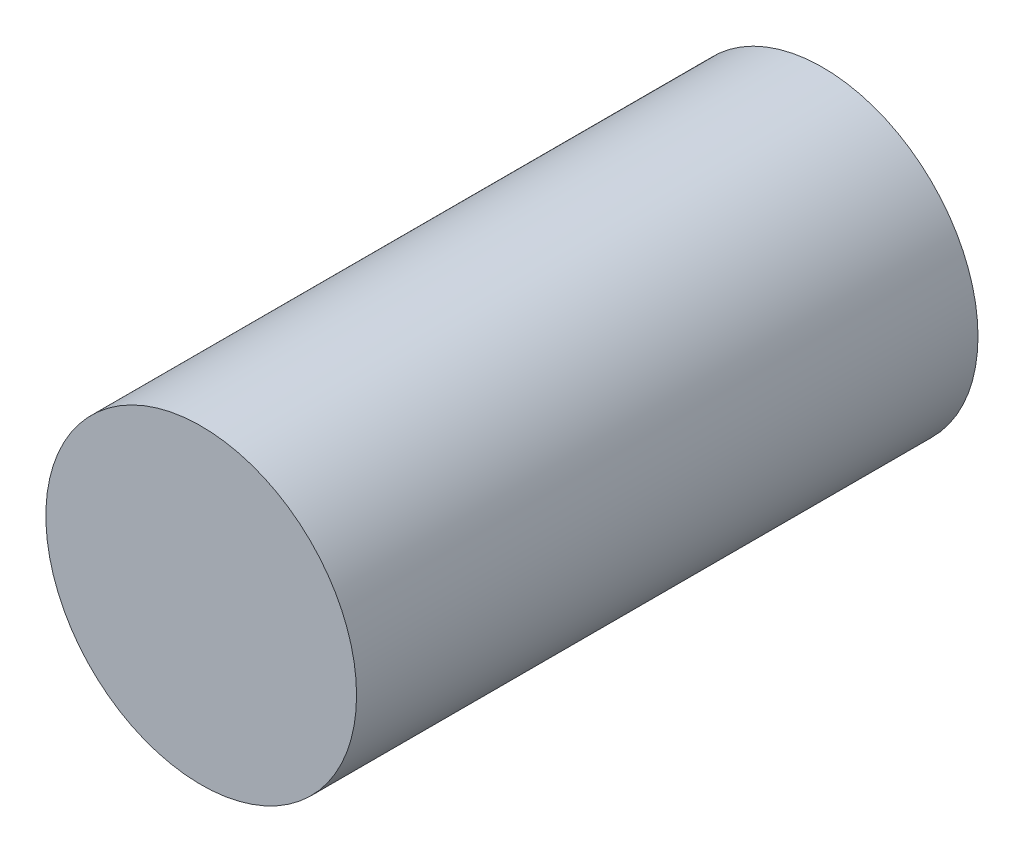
ISO-10303-21;
HEADER;
FILE_DESCRIPTION(('STEP AP214'),'2;1');
FILE_NAME('part.step','',(''),(''),'','','');
FILE_SCHEMA(('AUTOMOTIVE_DESIGN { 1 0 10303 214 1 1 1 1 }'));
ENDSEC;
DATA;
#1=APPLICATION_CONTEXT('core data for automotive mechanical design processes');
#2=APPLICATION_PROTOCOL_DEFINITION('international standard','automotive_design',2000,#1);
#3=PRODUCT_CONTEXT('',#1,'mechanical');
#4=PRODUCT('Part','Part','',(#3));
#5=PRODUCT_RELATED_PRODUCT_CATEGORY('part','',(#4));
#6=PRODUCT_DEFINITION_FORMATION('','',#4);
#7=PRODUCT_DEFINITION_CONTEXT('part definition',#1,'design');
#8=PRODUCT_DEFINITION('design','',#6,#7);
#9=PRODUCT_DEFINITION_SHAPE('','',#8);
#10=(LENGTH_UNIT() NAMED_UNIT(*) SI_UNIT(.MILLI.,.METRE.));
#11=(NAMED_UNIT(*) PLANE_ANGLE_UNIT() SI_UNIT($,.RADIAN.));
#12=(NAMED_UNIT(*) SI_UNIT($,.STERADIAN.) SOLID_ANGLE_UNIT());
#13=UNCERTAINTY_MEASURE_WITH_UNIT(LENGTH_MEASURE(1.E-05),#10,'distance_accuracy_value','');
#14=(GEOMETRIC_REPRESENTATION_CONTEXT(3) GLOBAL_UNCERTAINTY_ASSIGNED_CONTEXT((#13)) GLOBAL_UNIT_ASSIGNED_CONTEXT((#10,
#11,#12)) REPRESENTATION_CONTEXT('',''));
#15=CARTESIAN_POINT('',(0.,0.,0.));
#16=DIRECTION('',(0.,0.,1.));
#17=DIRECTION('',(1.,0.,0.));
#18=AXIS2_PLACEMENT_3D('',#15,#16,#17);
#19=CARTESIAN_POINT('',(0.,0.,3.));
#20=DIRECTION('',(0.,0.,-1.));
#21=DIRECTION('',(-1.,0.,0.));
#22=AXIS2_PLACEMENT_3D('',#19,#20,#21);
#23=CYLINDRICAL_SURFACE('',#22,0.75);
#24=CARTESIAN_POINT('',(0.,0.,3.));
#25=DIRECTION('',(0.,0.,1.));
#26=DIRECTION('',(1.,0.,0.));
#27=AXIS2_PLACEMENT_3D('',#24,#25,#26);
#28=CIRCLE('',#27,0.75);
#29=CARTESIAN_POINT('',(0.75,0.,3.));
#30=VERTEX_POINT('',#29);
#31=EDGE_CURVE('E10',#30,#30,#28,.T.);
#32=ORIENTED_EDGE('',*,*,#31,.F.);
#33=EDGE_LOOP('',(#32));
#34=FACE_BOUND('',#33,.T.);
#35=CARTESIAN_POINT('',(0.,0.,0.));
#36=DIRECTION('',(0.,0.,1.));
#37=DIRECTION('',(1.,0.,0.));
#38=AXIS2_PLACEMENT_3D('',#35,#36,#37);
#39=CIRCLE('',#38,0.75);
#40=CARTESIAN_POINT('',(0.75,0.,0.));
#41=VERTEX_POINT('',#40);
#42=EDGE_CURVE('E40',#41,#41,#39,.T.);
#43=ORIENTED_EDGE('',*,*,#42,.T.);
#44=EDGE_LOOP('',(#43));
#45=FACE_BOUND('',#44,.T.);
#46=ADVANCED_FACE('F37',(#34,#45),#23,.T.);
#47=CARTESIAN_POINT('',(0.,0.,3.));
#48=DIRECTION('',(0.,0.,1.));
#49=DIRECTION('',(1.,0.,0.));
#50=AXIS2_PLACEMENT_3D('',#47,#48,#49);
#51=PLANE('',#50);
#52=ORIENTED_EDGE('',*,*,#31,.T.);
#53=EDGE_LOOP('',(#52));
#54=FACE_BOUND('',#53,.T.);
#55=ADVANCED_FACE('F54',(#54),#51,.T.);
#56=CARTESIAN_POINT('',(0.,0.,0.));
#57=DIRECTION('',(0.,0.,1.));
#58=DIRECTION('',(1.,0.,0.));
#59=AXIS2_PLACEMENT_3D('',#56,#57,#58);
#60=PLANE('',#59);
#61=ORIENTED_EDGE('',*,*,#42,.F.);
#62=EDGE_LOOP('',(#61));
#63=FACE_BOUND('',#62,.T.);
#64=ADVANCED_FACE('F52',(#63),#60,.F.);
#65=CLOSED_SHELL('',(#46,#55,#64));
#66=MANIFOLD_SOLID_BREP('B2',#65);
#67=ADVANCED_BREP_SHAPE_REPRESENTATION('',(#18,#66),#14);
#68=SHAPE_DEFINITION_REPRESENTATION(#9,#67);
ENDSEC;
END-ISO-10303-21;
